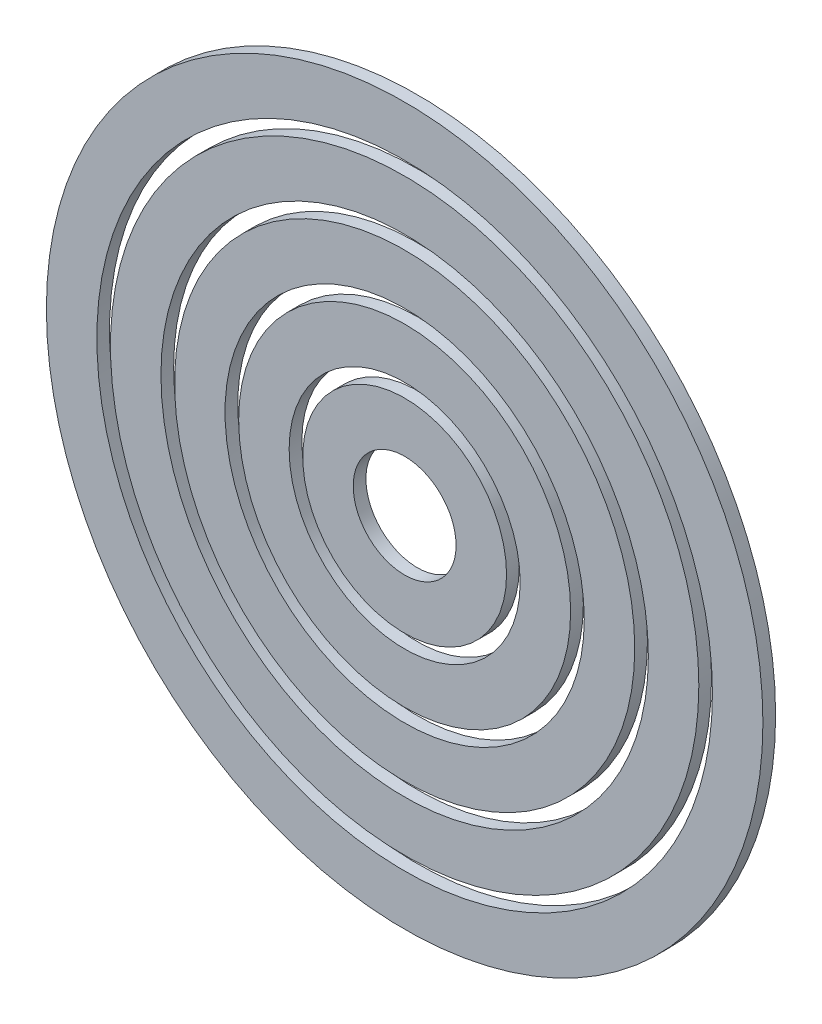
ISO-10303-21;
HEADER;
FILE_DESCRIPTION(('STEP AP214'),'2;1');
FILE_NAME('part.step','',(''),(''),'','','');
FILE_SCHEMA(('AUTOMOTIVE_DESIGN { 1 0 10303 214 1 1 1 1 }'));
ENDSEC;
DATA;
#1=APPLICATION_CONTEXT('core data for automotive mechanical design processes');
#2=APPLICATION_PROTOCOL_DEFINITION('international standard','automotive_design',2000,#1);
#3=PRODUCT_CONTEXT('',#1,'mechanical');
#4=PRODUCT('Part','Part','',(#3));
#5=PRODUCT_RELATED_PRODUCT_CATEGORY('part','',(#4));
#6=PRODUCT_DEFINITION_FORMATION('','',#4);
#7=PRODUCT_DEFINITION_CONTEXT('part definition',#1,'design');
#8=PRODUCT_DEFINITION('design','',#6,#7);
#9=PRODUCT_DEFINITION_SHAPE('','',#8);
#10=(LENGTH_UNIT() NAMED_UNIT(*) SI_UNIT(.MILLI.,.METRE.));
#11=(NAMED_UNIT(*) PLANE_ANGLE_UNIT() SI_UNIT($,.RADIAN.));
#12=(NAMED_UNIT(*) SI_UNIT($,.STERADIAN.) SOLID_ANGLE_UNIT());
#13=UNCERTAINTY_MEASURE_WITH_UNIT(LENGTH_MEASURE(1.E-05),#10,'distance_accuracy_value','');
#14=(GEOMETRIC_REPRESENTATION_CONTEXT(3) GLOBAL_UNCERTAINTY_ASSIGNED_CONTEXT((#13)) GLOBAL_UNIT_ASSIGNED_CONTEXT((#10,
#11,#12)) REPRESENTATION_CONTEXT('',''));
#15=CARTESIAN_POINT('',(0.,0.,0.));
#16=DIRECTION('',(0.,0.,1.));
#17=DIRECTION('',(1.,0.,0.));
#18=AXIS2_PLACEMENT_3D('',#15,#16,#17);
#19=CARTESIAN_POINT('',(0.,0.,1.9812));
#20=DIRECTION('',(0.,0.,-1.));
#21=DIRECTION('',(-1.,0.,0.));
#22=AXIS2_PLACEMENT_3D('',#19,#20,#21);
#23=CYLINDRICAL_SURFACE('',#22,8.026);
#24=CARTESIAN_POINT('',(0.,0.,1.9812));
#25=DIRECTION('',(0.,0.,1.));
#26=DIRECTION('',(1.,0.,0.));
#27=AXIS2_PLACEMENT_3D('',#24,#25,#26);
#28=CIRCLE('',#27,8.026);
#29=CARTESIAN_POINT('',(8.026,0.,1.9812));
#30=VERTEX_POINT('',#29);
#31=EDGE_CURVE('E113',#30,#30,#28,.T.);
#32=ORIENTED_EDGE('',*,*,#31,.T.);
#33=EDGE_LOOP('',(#32));
#34=FACE_BOUND('',#33,.T.);
#35=CARTESIAN_POINT('',(0.,0.,0.));
#36=DIRECTION('',(0.,0.,1.));
#37=DIRECTION('',(1.,0.,0.));
#38=AXIS2_PLACEMENT_3D('',#35,#36,#37);
#39=CIRCLE('',#38,8.026);
#40=CARTESIAN_POINT('',(8.026,0.,0.));
#41=VERTEX_POINT('',#40);
#42=EDGE_CURVE('E119',#41,#41,#39,.T.);
#43=ORIENTED_EDGE('',*,*,#42,.F.);
#44=EDGE_LOOP('',(#43));
#45=FACE_BOUND('',#44,.T.);
#46=ADVANCED_FACE('F106',(#34,#45),#23,.F.);
#47=CARTESIAN_POINT('',(0.,0.,1.9812));
#48=DIRECTION('',(0.,0.,-1.));
#49=DIRECTION('',(-1.,0.,0.));
#50=AXIS2_PLACEMENT_3D('',#47,#48,#49);
#51=CYLINDRICAL_SURFACE('',#50,15.9);
#52=CARTESIAN_POINT('',(0.,0.,1.9812));
#53=DIRECTION('',(0.,0.,1.));
#54=DIRECTION('',(1.,0.,0.));
#55=AXIS2_PLACEMENT_3D('',#52,#53,#54);
#56=CIRCLE('',#55,15.9);
#57=CARTESIAN_POINT('',(15.9,0.,1.9812));
#58=VERTEX_POINT('',#57);
#59=EDGE_CURVE('E12',#58,#58,#56,.T.);
#60=ORIENTED_EDGE('',*,*,#59,.F.);
#61=EDGE_LOOP('',(#60));
#62=FACE_BOUND('',#61,.T.);
#63=CARTESIAN_POINT('',(0.,0.,0.));
#64=DIRECTION('',(0.,0.,1.));
#65=DIRECTION('',(1.,0.,0.));
#66=AXIS2_PLACEMENT_3D('',#63,#64,#65);
#67=CIRCLE('',#66,15.9);
#68=CARTESIAN_POINT('',(15.9,0.,0.));
#69=VERTEX_POINT('',#68);
#70=EDGE_CURVE('E109',#69,#69,#67,.T.);
#71=ORIENTED_EDGE('',*,*,#70,.T.);
#72=EDGE_LOOP('',(#71));
#73=FACE_BOUND('',#72,.T.);
#74=ADVANCED_FACE('F126',(#62,#73),#51,.T.);
#75=CARTESIAN_POINT('',(0.,0.,1.9812));
#76=DIRECTION('',(0.,0.,1.));
#77=DIRECTION('',(1.,0.,0.));
#78=AXIS2_PLACEMENT_3D('',#75,#76,#77);
#79=PLANE('',#78);
#80=ORIENTED_EDGE('',*,*,#31,.F.);
#81=EDGE_LOOP('',(#80));
#82=FACE_BOUND('',#81,.T.);
#83=ORIENTED_EDGE('',*,*,#59,.T.);
#84=EDGE_LOOP('',(#83));
#85=FACE_BOUND('',#84,.T.);
#86=ADVANCED_FACE('F130',(#82,#85),#79,.T.);
#87=CARTESIAN_POINT('',(0.,0.,0.));
#88=DIRECTION('',(0.,0.,1.));
#89=DIRECTION('',(1.,0.,0.));
#90=AXIS2_PLACEMENT_3D('',#87,#88,#89);
#91=PLANE('',#90);
#92=ORIENTED_EDGE('',*,*,#42,.T.);
#93=EDGE_LOOP('',(#92));
#94=FACE_BOUND('',#93,.T.);
#95=ORIENTED_EDGE('',*,*,#70,.F.);
#96=EDGE_LOOP('',(#95));
#97=FACE_BOUND('',#96,.T.);
#98=ADVANCED_FACE('F128',(#94,#97),#91,.F.);
#99=CLOSED_SHELL('',(#46,#74,#86,#98));
#100=MANIFOLD_SOLID_BREP('B2',#99);
#101=CARTESIAN_POINT('',(0.,0.,1.9812));
#102=DIRECTION('',(0.,0.,-1.));
#103=DIRECTION('',(-1.,0.,0.));
#104=AXIS2_PLACEMENT_3D('',#101,#102,#103);
#105=CYLINDRICAL_SURFACE('',#104,18.026);
#106=CARTESIAN_POINT('',(0.,0.,1.9812));
#107=DIRECTION('',(0.,0.,1.));
#108=DIRECTION('',(1.,0.,0.));
#109=AXIS2_PLACEMENT_3D('',#106,#107,#108);
#110=CIRCLE('',#109,18.026);
#111=CARTESIAN_POINT('',(18.026,0.,1.9812));
#112=VERTEX_POINT('',#111);
#113=EDGE_CURVE('E183',#112,#112,#110,.T.);
#114=ORIENTED_EDGE('',*,*,#113,.T.);
#115=EDGE_LOOP('',(#114));
#116=FACE_BOUND('',#115,.T.);
#117=CARTESIAN_POINT('',(0.,0.,0.));
#118=DIRECTION('',(0.,0.,1.));
#119=DIRECTION('',(1.,0.,0.));
#120=AXIS2_PLACEMENT_3D('',#117,#118,#119);
#121=CIRCLE('',#120,18.026);
#122=CARTESIAN_POINT('',(18.026,0.,0.));
#123=VERTEX_POINT('',#122);
#124=EDGE_CURVE('E189',#123,#123,#121,.T.);
#125=ORIENTED_EDGE('',*,*,#124,.F.);
#126=EDGE_LOOP('',(#125));
#127=FACE_BOUND('',#126,.T.);
#128=ADVANCED_FACE('F176',(#116,#127),#105,.F.);
#129=CARTESIAN_POINT('',(0.,0.,1.9812));
#130=DIRECTION('',(0.,0.,-1.));
#131=DIRECTION('',(-1.,0.,0.));
#132=AXIS2_PLACEMENT_3D('',#129,#130,#131);
#133=CYLINDRICAL_SURFACE('',#132,25.9);
#134=CARTESIAN_POINT('',(0.,0.,1.9812));
#135=DIRECTION('',(0.,0.,1.));
#136=DIRECTION('',(1.,0.,0.));
#137=AXIS2_PLACEMENT_3D('',#134,#135,#136);
#138=CIRCLE('',#137,25.9);
#139=CARTESIAN_POINT('',(25.9,0.,1.9812));
#140=VERTEX_POINT('',#139);
#141=EDGE_CURVE('E105',#140,#140,#138,.T.);
#142=ORIENTED_EDGE('',*,*,#141,.F.);
#143=EDGE_LOOP('',(#142));
#144=FACE_BOUND('',#143,.T.);
#145=CARTESIAN_POINT('',(0.,0.,0.));
#146=DIRECTION('',(0.,0.,1.));
#147=DIRECTION('',(1.,0.,0.));
#148=AXIS2_PLACEMENT_3D('',#145,#146,#147);
#149=CIRCLE('',#148,25.9);
#150=CARTESIAN_POINT('',(25.9,0.,0.));
#151=VERTEX_POINT('',#150);
#152=EDGE_CURVE('E179',#151,#151,#149,.T.);
#153=ORIENTED_EDGE('',*,*,#152,.T.);
#154=EDGE_LOOP('',(#153));
#155=FACE_BOUND('',#154,.T.);
#156=ADVANCED_FACE('F196',(#144,#155),#133,.T.);
#157=CARTESIAN_POINT('',(0.,0.,1.9812));
#158=DIRECTION('',(0.,0.,1.));
#159=DIRECTION('',(1.,0.,0.));
#160=AXIS2_PLACEMENT_3D('',#157,#158,#159);
#161=PLANE('',#160);
#162=ORIENTED_EDGE('',*,*,#113,.F.);
#163=EDGE_LOOP('',(#162));
#164=FACE_BOUND('',#163,.T.);
#165=ORIENTED_EDGE('',*,*,#141,.T.);
#166=EDGE_LOOP('',(#165));
#167=FACE_BOUND('',#166,.T.);
#168=ADVANCED_FACE('F200',(#164,#167),#161,.T.);
#169=CARTESIAN_POINT('',(0.,0.,0.));
#170=DIRECTION('',(0.,0.,1.));
#171=DIRECTION('',(1.,0.,0.));
#172=AXIS2_PLACEMENT_3D('',#169,#170,#171);
#173=PLANE('',#172);
#174=ORIENTED_EDGE('',*,*,#124,.T.);
#175=EDGE_LOOP('',(#174));
#176=FACE_BOUND('',#175,.T.);
#177=ORIENTED_EDGE('',*,*,#152,.F.);
#178=EDGE_LOOP('',(#177));
#179=FACE_BOUND('',#178,.T.);
#180=ADVANCED_FACE('F198',(#176,#179),#173,.F.);
#181=CLOSED_SHELL('',(#128,#156,#168,#180));
#182=MANIFOLD_SOLID_BREP('B7',#181);
#183=CARTESIAN_POINT('',(0.,0.,1.9812));
#184=DIRECTION('',(0.,0.,-1.));
#185=DIRECTION('',(-1.,0.,0.));
#186=AXIS2_PLACEMENT_3D('',#183,#184,#185);
#187=CYLINDRICAL_SURFACE('',#186,28.026);
#188=CARTESIAN_POINT('',(0.,0.,1.9812));
#189=DIRECTION('',(0.,0.,1.));
#190=DIRECTION('',(1.,0.,0.));
#191=AXIS2_PLACEMENT_3D('',#188,#189,#190);
#192=CIRCLE('',#191,28.026);
#193=CARTESIAN_POINT('',(28.026,0.,1.9812));
#194=VERTEX_POINT('',#193);
#195=EDGE_CURVE('E253',#194,#194,#192,.T.);
#196=ORIENTED_EDGE('',*,*,#195,.T.);
#197=EDGE_LOOP('',(#196));
#198=FACE_BOUND('',#197,.T.);
#199=CARTESIAN_POINT('',(0.,0.,0.));
#200=DIRECTION('',(0.,0.,1.));
#201=DIRECTION('',(1.,0.,0.));
#202=AXIS2_PLACEMENT_3D('',#199,#200,#201);
#203=CIRCLE('',#202,28.026);
#204=CARTESIAN_POINT('',(28.026,0.,0.));
#205=VERTEX_POINT('',#204);
#206=EDGE_CURVE('E259',#205,#205,#203,.T.);
#207=ORIENTED_EDGE('',*,*,#206,.F.);
#208=EDGE_LOOP('',(#207));
#209=FACE_BOUND('',#208,.T.);
#210=ADVANCED_FACE('F246',(#198,#209),#187,.F.);
#211=CARTESIAN_POINT('',(0.,0.,1.9812));
#212=DIRECTION('',(0.,0.,-1.));
#213=DIRECTION('',(-1.,0.,0.));
#214=AXIS2_PLACEMENT_3D('',#211,#212,#213);
#215=CYLINDRICAL_SURFACE('',#214,35.9);
#216=CARTESIAN_POINT('',(0.,0.,1.9812));
#217=DIRECTION('',(0.,0.,1.));
#218=DIRECTION('',(1.,0.,0.));
#219=AXIS2_PLACEMENT_3D('',#216,#217,#218);
#220=CIRCLE('',#219,35.9);
#221=CARTESIAN_POINT('',(35.9,0.,1.9812));
#222=VERTEX_POINT('',#221);
#223=EDGE_CURVE('E175',#222,#222,#220,.T.);
#224=ORIENTED_EDGE('',*,*,#223,.F.);
#225=EDGE_LOOP('',(#224));
#226=FACE_BOUND('',#225,.T.);
#227=CARTESIAN_POINT('',(0.,0.,0.));
#228=DIRECTION('',(0.,0.,1.));
#229=DIRECTION('',(1.,0.,0.));
#230=AXIS2_PLACEMENT_3D('',#227,#228,#229);
#231=CIRCLE('',#230,35.9);
#232=CARTESIAN_POINT('',(35.9,0.,0.));
#233=VERTEX_POINT('',#232);
#234=EDGE_CURVE('E249',#233,#233,#231,.T.);
#235=ORIENTED_EDGE('',*,*,#234,.T.);
#236=EDGE_LOOP('',(#235));
#237=FACE_BOUND('',#236,.T.);
#238=ADVANCED_FACE('F266',(#226,#237),#215,.T.);
#239=CARTESIAN_POINT('',(0.,0.,1.9812));
#240=DIRECTION('',(0.,0.,1.));
#241=DIRECTION('',(1.,0.,0.));
#242=AXIS2_PLACEMENT_3D('',#239,#240,#241);
#243=PLANE('',#242);
#244=ORIENTED_EDGE('',*,*,#195,.F.);
#245=EDGE_LOOP('',(#244));
#246=FACE_BOUND('',#245,.T.);
#247=ORIENTED_EDGE('',*,*,#223,.T.);
#248=EDGE_LOOP('',(#247));
#249=FACE_BOUND('',#248,.T.);
#250=ADVANCED_FACE('F270',(#246,#249),#243,.T.);
#251=CARTESIAN_POINT('',(0.,0.,0.));
#252=DIRECTION('',(0.,0.,1.));
#253=DIRECTION('',(1.,0.,0.));
#254=AXIS2_PLACEMENT_3D('',#251,#252,#253);
#255=PLANE('',#254);
#256=ORIENTED_EDGE('',*,*,#206,.T.);
#257=EDGE_LOOP('',(#256));
#258=FACE_BOUND('',#257,.T.);
#259=ORIENTED_EDGE('',*,*,#234,.F.);
#260=EDGE_LOOP('',(#259));
#261=FACE_BOUND('',#260,.T.);
#262=ADVANCED_FACE('F268',(#258,#261),#255,.F.);
#263=CLOSED_SHELL('',(#210,#238,#250,#262));
#264=MANIFOLD_SOLID_BREP('B100',#263);
#265=CARTESIAN_POINT('',(0.,0.,1.9812));
#266=DIRECTION('',(0.,0.,-1.));
#267=DIRECTION('',(-1.,0.,0.));
#268=AXIS2_PLACEMENT_3D('',#265,#266,#267);
#269=CYLINDRICAL_SURFACE('',#268,38.026);
#270=CARTESIAN_POINT('',(0.,0.,1.9812));
#271=DIRECTION('',(0.,0.,1.));
#272=DIRECTION('',(1.,0.,0.));
#273=AXIS2_PLACEMENT_3D('',#270,#271,#272);
#274=CIRCLE('',#273,38.026);
#275=CARTESIAN_POINT('',(38.026,0.,1.9812));
#276=VERTEX_POINT('',#275);
#277=EDGE_CURVE('E322',#276,#276,#274,.T.);
#278=ORIENTED_EDGE('',*,*,#277,.T.);
#279=EDGE_LOOP('',(#278));
#280=FACE_BOUND('',#279,.T.);
#281=CARTESIAN_POINT('',(0.,0.,0.));
#282=DIRECTION('',(0.,0.,1.));
#283=DIRECTION('',(1.,0.,0.));
#284=AXIS2_PLACEMENT_3D('',#281,#282,#283);
#285=CIRCLE('',#284,38.026);
#286=CARTESIAN_POINT('',(38.026,0.,0.));
#287=VERTEX_POINT('',#286);
#288=EDGE_CURVE('E328',#287,#287,#285,.T.);
#289=ORIENTED_EDGE('',*,*,#288,.F.);
#290=EDGE_LOOP('',(#289));
#291=FACE_BOUND('',#290,.T.);
#292=ADVANCED_FACE('F315',(#280,#291),#269,.F.);
#293=CARTESIAN_POINT('',(0.,0.,1.9812));
#294=DIRECTION('',(0.,0.,-1.));
#295=DIRECTION('',(-1.,0.,0.));
#296=AXIS2_PLACEMENT_3D('',#293,#294,#295);
#297=CYLINDRICAL_SURFACE('',#296,45.9);
#298=CARTESIAN_POINT('',(0.,0.,1.9812));
#299=DIRECTION('',(0.,0.,1.));
#300=DIRECTION('',(1.,0.,0.));
#301=AXIS2_PLACEMENT_3D('',#298,#299,#300);
#302=CIRCLE('',#301,45.9);
#303=CARTESIAN_POINT('',(45.9,0.,1.9812));
#304=VERTEX_POINT('',#303);
#305=EDGE_CURVE('E245',#304,#304,#302,.T.);
#306=ORIENTED_EDGE('',*,*,#305,.F.);
#307=EDGE_LOOP('',(#306));
#308=FACE_BOUND('',#307,.T.);
#309=CARTESIAN_POINT('',(0.,0.,0.));
#310=DIRECTION('',(0.,0.,1.));
#311=DIRECTION('',(1.,0.,0.));
#312=AXIS2_PLACEMENT_3D('',#309,#310,#311);
#313=CIRCLE('',#312,45.9);
#314=CARTESIAN_POINT('',(45.9,0.,0.));
#315=VERTEX_POINT('',#314);
#316=EDGE_CURVE('E318',#315,#315,#313,.T.);
#317=ORIENTED_EDGE('',*,*,#316,.T.);
#318=EDGE_LOOP('',(#317));
#319=FACE_BOUND('',#318,.T.);
#320=ADVANCED_FACE('F335',(#308,#319),#297,.T.);
#321=CARTESIAN_POINT('',(0.,0.,1.9812));
#322=DIRECTION('',(0.,0.,1.));
#323=DIRECTION('',(1.,0.,0.));
#324=AXIS2_PLACEMENT_3D('',#321,#322,#323);
#325=PLANE('',#324);
#326=ORIENTED_EDGE('',*,*,#277,.F.);
#327=EDGE_LOOP('',(#326));
#328=FACE_BOUND('',#327,.T.);
#329=ORIENTED_EDGE('',*,*,#305,.T.);
#330=EDGE_LOOP('',(#329));
#331=FACE_BOUND('',#330,.T.);
#332=ADVANCED_FACE('F339',(#328,#331),#325,.T.);
#333=CARTESIAN_POINT('',(0.,0.,0.));
#334=DIRECTION('',(0.,0.,1.));
#335=DIRECTION('',(1.,0.,0.));
#336=AXIS2_PLACEMENT_3D('',#333,#334,#335);
#337=PLANE('',#336);
#338=ORIENTED_EDGE('',*,*,#288,.T.);
#339=EDGE_LOOP('',(#338));
#340=FACE_BOUND('',#339,.T.);
#341=ORIENTED_EDGE('',*,*,#316,.F.);
#342=EDGE_LOOP('',(#341));
#343=FACE_BOUND('',#342,.T.);
#344=ADVANCED_FACE('F337',(#340,#343),#337,.F.);
#345=CLOSED_SHELL('',(#292,#320,#332,#344));
#346=MANIFOLD_SOLID_BREP('B170',#345);
#347=CARTESIAN_POINT('',(0.,0.,1.9812));
#348=DIRECTION('',(0.,0.,-1.));
#349=DIRECTION('',(-1.,0.,0.));
#350=AXIS2_PLACEMENT_3D('',#347,#348,#349);
#351=CYLINDRICAL_SURFACE('',#350,48.026);
#352=CARTESIAN_POINT('',(0.,0.,1.9812));
#353=DIRECTION('',(0.,0.,1.));
#354=DIRECTION('',(1.,0.,0.));
#355=AXIS2_PLACEMENT_3D('',#352,#353,#354);
#356=CIRCLE('',#355,48.026);
#357=CARTESIAN_POINT('',(48.026,0.,1.9812));
#358=VERTEX_POINT('',#357);
#359=EDGE_CURVE('E385',#358,#358,#356,.T.);
#360=ORIENTED_EDGE('',*,*,#359,.T.);
#361=EDGE_LOOP('',(#360));
#362=FACE_BOUND('',#361,.T.);
#363=CARTESIAN_POINT('',(0.,0.,0.));
#364=DIRECTION('',(0.,0.,1.));
#365=DIRECTION('',(1.,0.,0.));
#366=AXIS2_PLACEMENT_3D('',#363,#364,#365);
#367=CIRCLE('',#366,48.026);
#368=CARTESIAN_POINT('',(48.026,0.,0.));
#369=VERTEX_POINT('',#368);
#370=EDGE_CURVE('E392',#369,#369,#367,.T.);
#371=ORIENTED_EDGE('',*,*,#370,.F.);
#372=EDGE_LOOP('',(#371));
#373=FACE_BOUND('',#372,.T.);
#374=ADVANCED_FACE('F377',(#362,#373),#351,.F.);
#375=CARTESIAN_POINT('',(0.,0.,1.9812));
#376=DIRECTION('',(0.,0.,-1.));
#377=DIRECTION('',(-1.,0.,0.));
#378=AXIS2_PLACEMENT_3D('',#375,#376,#377);
#379=CYLINDRICAL_SURFACE('',#378,55.9);
#380=CARTESIAN_POINT('',(0.,0.,1.9812));
#381=DIRECTION('',(0.,0.,1.));
#382=DIRECTION('',(1.,0.,0.));
#383=AXIS2_PLACEMENT_3D('',#380,#381,#382);
#384=CIRCLE('',#383,55.9);
#385=CARTESIAN_POINT('',(55.9,0.,1.9812));
#386=VERTEX_POINT('',#385);
#387=EDGE_CURVE('E314',#386,#386,#384,.T.);
#388=ORIENTED_EDGE('',*,*,#387,.F.);
#389=EDGE_LOOP('',(#388));
#390=FACE_BOUND('',#389,.T.);
#391=CARTESIAN_POINT('',(0.,0.,0.));
#392=DIRECTION('',(0.,0.,1.));
#393=DIRECTION('',(1.,0.,0.));
#394=AXIS2_PLACEMENT_3D('',#391,#392,#393);
#395=CIRCLE('',#394,55.9);
#396=CARTESIAN_POINT('',(55.9,0.,0.));
#397=VERTEX_POINT('',#396);
#398=EDGE_CURVE('E380',#397,#397,#395,.T.);
#399=ORIENTED_EDGE('',*,*,#398,.T.);
#400=EDGE_LOOP('',(#399));
#401=FACE_BOUND('',#400,.T.);
#402=ADVANCED_FACE('F401',(#390,#401),#379,.T.);
#403=CARTESIAN_POINT('',(0.,0.,1.9812));
#404=DIRECTION('',(0.,0.,1.));
#405=DIRECTION('',(1.,0.,0.));
#406=AXIS2_PLACEMENT_3D('',#403,#404,#405);
#407=PLANE('',#406);
#408=ORIENTED_EDGE('',*,*,#359,.F.);
#409=EDGE_LOOP('',(#408));
#410=FACE_BOUND('',#409,.T.);
#411=ORIENTED_EDGE('',*,*,#387,.T.);
#412=EDGE_LOOP('',(#411));
#413=FACE_BOUND('',#412,.T.);
#414=ADVANCED_FACE('F405',(#410,#413),#407,.T.);
#415=CARTESIAN_POINT('',(0.,0.,0.));
#416=DIRECTION('',(0.,0.,1.));
#417=DIRECTION('',(1.,0.,0.));
#418=AXIS2_PLACEMENT_3D('',#415,#416,#417);
#419=PLANE('',#418);
#420=ORIENTED_EDGE('',*,*,#370,.T.);
#421=EDGE_LOOP('',(#420));
#422=FACE_BOUND('',#421,.T.);
#423=ORIENTED_EDGE('',*,*,#398,.F.);
#424=EDGE_LOOP('',(#423));
#425=FACE_BOUND('',#424,.T.);
#426=ADVANCED_FACE('F403',(#422,#425),#419,.F.);
#427=CLOSED_SHELL('',(#374,#402,#414,#426));
#428=MANIFOLD_SOLID_BREP('B240',#427);
#429=ADVANCED_BREP_SHAPE_REPRESENTATION('',(#18,#100,#182,#264,#346,#428),#14);
#430=SHAPE_DEFINITION_REPRESENTATION(#9,#429);
ENDSEC;
END-ISO-10303-21;
